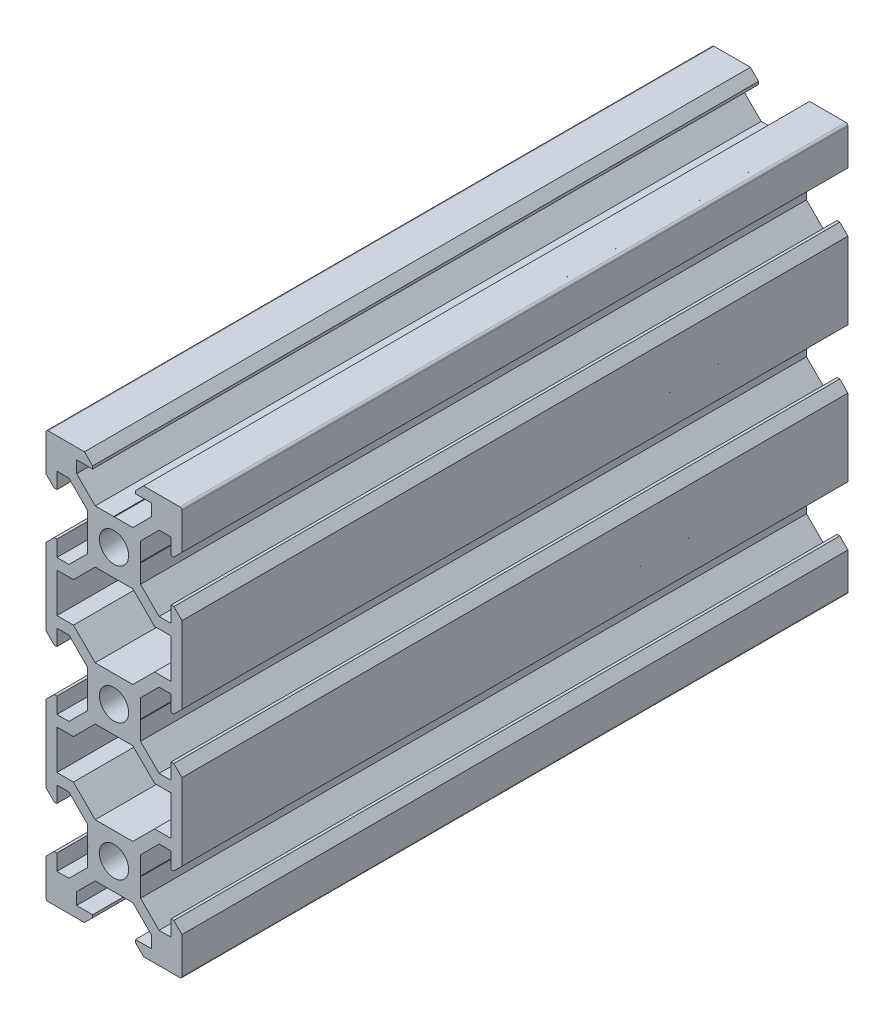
from build123d import *

# Parameters (mm, degrees)
SKETCH1_R           = 2.15
BOSS_EXTRUDE1_DEPTH = 98


with BuildPart() as part:
    # Sketch1 → Boss-Extrude1 (new body)
    with BuildSketch(Plane.XY):
        with BuildLine():
            Line((10, 24.348649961), (10, 29.698649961))
            ThreePointArc((10, 29.698649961), (9.912132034, 29.910781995), (9.7, 29.998649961))
            Line((9.7, 29.998649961), (4.35, 29.998649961))
            Line((4.35, 29.998649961), (3.15, 28.798649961))
            Line((3.15, 28.798649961), (3.15, 28.398049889))
            Line((3.15, 28.398049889), (5.5, 28.398649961))
            Line((5.5, 28.398649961), (5.5, 26.631049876))
            Line((5.5, 26.631049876), (2.767048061, 23.897449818))
            Line((2.767048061, 23.897449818), (0.058144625, 23.897449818))
            Line((0.058144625, 23.897449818), (0.000409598, 23.797449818))
            Line((0.000409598, 23.797449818), (-0.057325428, 23.897449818))
            Line((-0.057325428, 23.897449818), (-2.766228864, 23.897449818))
            Line((-2.766228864, 23.897449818), (-5.5, 26.631220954))
            Line((-5.5, 26.631220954), (-5.5, 28.398649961))
            Line((-5.5, 28.398649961), (-3.15, 28.398649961))
            Line((-3.15, 28.398649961), (-3.15, 28.798649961))
            Line((-3.15, 28.798649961), (-4.35, 29.998649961))
            Line((-4.35, 29.998649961), (-9.7, 29.998649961))
            ThreePointArc((-9.7, 29.998649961), (-9.912132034, 29.910781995), (-10, 29.698649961))
            Line((-10, 29.698649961), (-10, 24.348649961))
            Line((-10, 24.348649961), (-8.8, 23.148649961))
            Line((-8.8, 23.148649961), (-8.4, 23.148649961))
            Line((-8.4, 23.148649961), (-8.4, 25.498649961))
            Line((-8.4, 25.498649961), (-6.63845088, 25.498649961))
            Line((-6.63845088, 25.498649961), (-3.9, 22.761910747))
            Line((-3.9, 22.761910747), (-3.9, 20.053100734))
            Line((-3.9, 20.053100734), (-3.8, 19.995365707))
            Line((-3.8, 19.995365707), (-3.9, 19.937630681))
            Line((-3.9, 19.937630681), (-3.9, 17.228820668))
            Line((-3.9, 17.228820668), (-6.629523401, 14.498649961))
            Line((-6.629523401, 14.498649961), (-8.4, 14.498649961))
            Line((-8.4, 14.498649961), (-8.4, 16.848649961))
            Line((-8.4, 16.848649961), (-8.8, 16.848649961))
            Line((-8.8, 16.848649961), (-10, 15.648649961))
            Line((-10, 15.648649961), (-10, 4.348649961))
            Line((-10, 4.348649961), (-8.8, 3.148649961))
            Line((-8.8, 3.148649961), (-8.4, 3.148649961))
            Line((-8.4, 3.148649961), (-8.4, 5.498649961))
            Line((-8.4, 5.498649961), (-6.632570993, 5.498649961))
            Line((-6.632570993, 5.498649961), (-3.9, 2.766078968))
            Line((-3.9, 2.766078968), (-3.90009153, 0.056384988))
            Line((-3.90009153, 0.056384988), (-3.80018306, -0.001350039))
            Line((-3.80018306, -0.001350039), (-3.9, -0.059085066))
            Line((-3.9, -0.059085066), (-3.90018306, -2.768962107))
            Line((-3.90018306, -2.768962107), (-6.632570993, -5.501350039))
            Line((-6.632570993, -5.501350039), (-8.4, -5.501350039))
            Line((-8.4, -5.501350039), (-8.4, -3.151350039))
            Line((-8.4, -3.151350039), (-8.8, -3.151350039))
            Line((-8.8, -3.151350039), (-10, -4.351350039))
            Line((-10, -4.351350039), (-10, -15.650149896))
            Line((-10, -15.650149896), (-8.8, -16.850149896))
            Line((-8.8, -16.850149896), (-8.4, -16.850149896))
            Line((-8.4, -16.850149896), (-8.4, -14.500149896))
            Line((-8.4, -14.500149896), (-6.631521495, -14.500106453))
            Line((-6.631521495, -14.500106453), (-3.9, -17.231908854))
            Line((-3.9, -17.231908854), (-3.899805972, -19.942414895))
            Line((-3.899805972, -19.942414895), (-3.799611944, -20.000149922))
            Line((-3.799611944, -20.000149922), (-3.899805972, -20.058078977))
            Line((-3.899805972, -20.058078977), (-3.9, -22.768779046))
            Line((-3.9, -22.768779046), (-6.63137085, -25.500749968))
            Line((-6.63137085, -25.500749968), (-8.4, -25.500749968))
            Line((-8.4, -25.500749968), (-8.4, -23.150149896))
            Line((-8.4, -23.150149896), (-8.8, -23.150149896))
            Line((-8.8, -23.150149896), (-10, -24.350149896))
            Line((-10, -24.350149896), (-10, -29.701350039))
            ThreePointArc((-10, -29.701350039), (-9.912132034, -29.913482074), (-9.7, -30.001350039))
            Line((-9.7, -30.001350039), (-4.35, -30.001350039))
            Line((-4.35, -30.001350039), (-3.15, -28.801350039))
            Line((-3.15, -28.801350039), (-3.15, -28.401350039))
            Line((-3.15, -28.401350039), (-5.5, -28.401350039))
            Line((-5.5, -28.401350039), (-5.5, -26.631949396))
            Line((-5.5, -26.631949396), (-2.768241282, -23.900538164))
            Line((-2.768241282, -23.900538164), (-0.057347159, -23.900538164))
            Line((-0.057347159, -23.900538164), (0.000388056, -23.800537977))
            Line((0.000388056, -23.800537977), (0.058122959, -23.900944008))
            Line((0.058122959, -23.900944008), (2.769016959, -23.901350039))
            Line((2.769016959, -23.901350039), (5.499656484, -26.631670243))
            Line((5.499656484, -26.631670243), (5.5, -28.401350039))
            Line((5.5, -28.401350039), (3.15, -28.401350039))
            Line((3.15, -28.401350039), (3.15, -28.801350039))
            Line((3.15, -28.801350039), (4.35, -30.001350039))
            Line((4.35, -30.001350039), (9.7, -30.001350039))
            ThreePointArc((9.7, -30.001350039), (9.912132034, -29.913482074), (10, -29.701350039))
            Line((10, -29.701350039), (10, -24.350149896))
            Line((10, -24.350149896), (8.8, -23.150149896))
            Line((8.8, -23.150149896), (8.4, -23.150149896))
            Line((8.4, -23.150149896), (8.4, -25.500149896))
            Line((8.4, -25.500149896), (6.63137085, -25.500149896))
            Line((6.63137085, -25.500149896), (3.9, -22.768779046))
            Line((3.9, -22.768779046), (3.900194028, -20.058697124))
            Line((3.900194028, -20.058697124), (3.800388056, -20.000962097))
            Line((3.800388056, -20.000962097), (3.900194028, -19.943033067))
            Line((3.900194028, -19.943033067), (3.9, -17.233145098))
            Line((3.9, -17.233145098), (6.633342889, -14.500149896))
            Line((6.633342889, -14.500149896), (8.4, -14.500149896))
            Line((8.4, -14.500149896), (8.4, -16.850149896))
            Line((8.4, -16.850149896), (8.8, -16.850149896))
            Line((8.8, -16.850149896), (10, -15.650149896))
            Line((10, -15.650149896), (10, -4.351350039))
            Line((10, -4.351350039), (8.8, -3.151350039))
            Line((8.8, -3.151350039), (8.4, -3.151350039))
            Line((8.4, -3.151350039), (8.4, -5.501350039))
            Line((8.4, -5.501350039), (6.63192316, -5.501350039))
            Line((6.63192316, -5.501350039), (3.9, -2.769952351))
            Line((3.9, -2.769952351), (3.89990847, -0.057735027))
            Line((3.89990847, -0.057735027), (3.79981694, 0))
            Line((3.79981694, 0), (3.89990847, 0.057735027))
            Line((3.89990847, 0.057735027), (3.9, 2.769952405))
            Line((3.9, 2.769952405), (6.628408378, 5.498649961))
            Line((6.628408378, 5.498649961), (8.4, 5.498649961))
            Line((8.4, 5.498649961), (8.4, 3.148649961))
            Line((8.4, 3.148649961), (8.8, 3.148649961))
            Line((8.8, 3.148649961), (10, 4.348649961))
            Line((10, 4.348649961), (10, 15.648649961))
            Line((10, 15.648649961), (8.8, 16.848649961))
            Line((8.8, 16.848649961), (8.4, 16.848649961))
            Line((8.4, 16.848649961), (8.4, 14.498649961))
            Line((8.4, 14.498649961), (6.632570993, 14.498649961))
            Line((6.632570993, 14.498649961), (3.9, 17.231220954))
            Line((3.9, 17.231220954), (3.9, 19.940914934))
            Line((3.9, 19.940914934), (3.8, 19.998649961))
            Line((3.8, 19.998649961), (3.9, 20.056384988))
            Line((3.9, 20.056384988), (3.9, 22.766078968))
            Line((3.9, 22.766078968), (6.632570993, 25.498649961))
            Line((6.632570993, 25.498649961), (8.4, 25.498649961))
            Line((8.4, 25.498649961), (8.4, 23.148649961))
            Line((8.4, 23.148649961), (8.8, 23.148649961))
            Line((8.8, 23.148649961), (10, 24.348649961))
        make_face()
        with Locations(Location((0, 19.998649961, 0), (0, 0, 180))):
            Circle(SKETCH1_R, mode=Mode.SUBTRACT)
        with Locations(Location((0, 0, 0), (0, 0, 180))):
            Circle(SKETCH1_R, mode=Mode.SUBTRACT)
        with Locations(Location((0.000388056, -20.000962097, 0), (0, 0, 180))):
            Circle(SKETCH1_R, mode=Mode.SUBTRACT)
        Polygon((-2.76862915, 16.097449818), (-5.967429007, 12.898649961), (-8.4, 12.898649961), (-8.4, 7.098649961), (-5.970472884, 7.098649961), (-2.769829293, 3.898649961), (2.767429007, 3.898649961), (5.967429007, 7.098649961), (8.4, 7.098649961), (8.4, 12.898649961), (5.967429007, 12.898649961), (2.76862915, 16.097449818), align=None, mode=Mode.SUBTRACT)
        Polygon((5.967429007, -12.9), (8.4, -12.9), (8.4, -7.1), (5.967429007, -7.1), (2.76862915, -3.901200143), (-2.76862915, -3.901200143), (-5.967429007, -7.1), (-8.4, -7.1), (-8.4, -12.9), (-5.970472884, -12.9), (-2.769829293, -16.1), (2.767429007, -16.1), align=None, mode=Mode.SUBTRACT)
    extrude(amount=BOSS_EXTRUDE1_DEPTH)


solid = part.part
